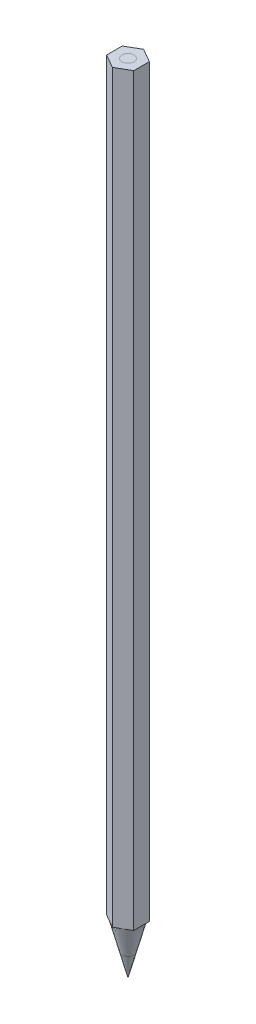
from build123d import *

# Parameters (mm, degrees)
ESQUISSE1_R      = 1.5
EXTRUSION1_DEPTH = 200
ESQUISSE2_R      = 1.5
EXTRUSION2_DEPTH = 200


with BuildPart() as part:
    # Esquisse1 → Extrusion1 (new body)
    with BuildSketch(Plane(origin=(0, 0, 0), x_dir=(1, 0, 0), z_dir=(0, 1, 0))):
        Polygon((0, 3.92598183), (-3.4, 1.962990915), (-3.4, -1.962990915), (0, -3.92598183), (3.4, -1.962990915), (3.4, 1.962990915), align=None)
        with Locations(Location((0, 0, 0), (0, 0, 270))):
            Circle(ESQUISSE1_R, mode=Mode.SUBTRACT)
    extrude(amount=EXTRUSION1_DEPTH)


with BuildPart() as body_2:
    # Esquisse2 → Extrusion2 (new body)
    with BuildSketch(Plane(origin=(0, 0, 0), x_dir=(1, 0, 0), z_dir=(0, 1, 0))):
        with Locations(Location((0, 0, 0), (0, 0, 270))):
            Circle(ESQUISSE2_R)
    extrude(amount=EXTRUSION2_DEPTH)


with BuildPart() as enl_vement_de_mati_re_r_volution2_tool:
    # Esquisse3 → Enl_vement de mati_re-R_volution2 (revolve)
    with BuildSketch(Plane.XY):
        Polygon((0, 0), (3.4, 13.008320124), (7.976145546, 13.008320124), (7.976145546, -5.270860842), (0, -5.270860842), align=None)
    revolve(axis=Axis((0, 0, 0), (0, 1, 0)))


with BuildPart() as part_1:
    add(part.part)

    # Enl_vement de mati_re-R_volution2: cut by enl_vement_de_mati_re_r_volution2_tool
    add(enl_vement_de_mati_re_r_volution2_tool.part, mode=Mode.SUBTRACT)


with BuildPart() as body_2_1:
    add(body_2.part)

    # Enl_vement de mati_re-R_volution2: cut by enl_vement_de_mati_re_r_volution2_tool
    add(enl_vement_de_mati_re_r_volution2_tool.part, mode=Mode.SUBTRACT)


solid = Compound([part_1.part, body_2_1.part])
